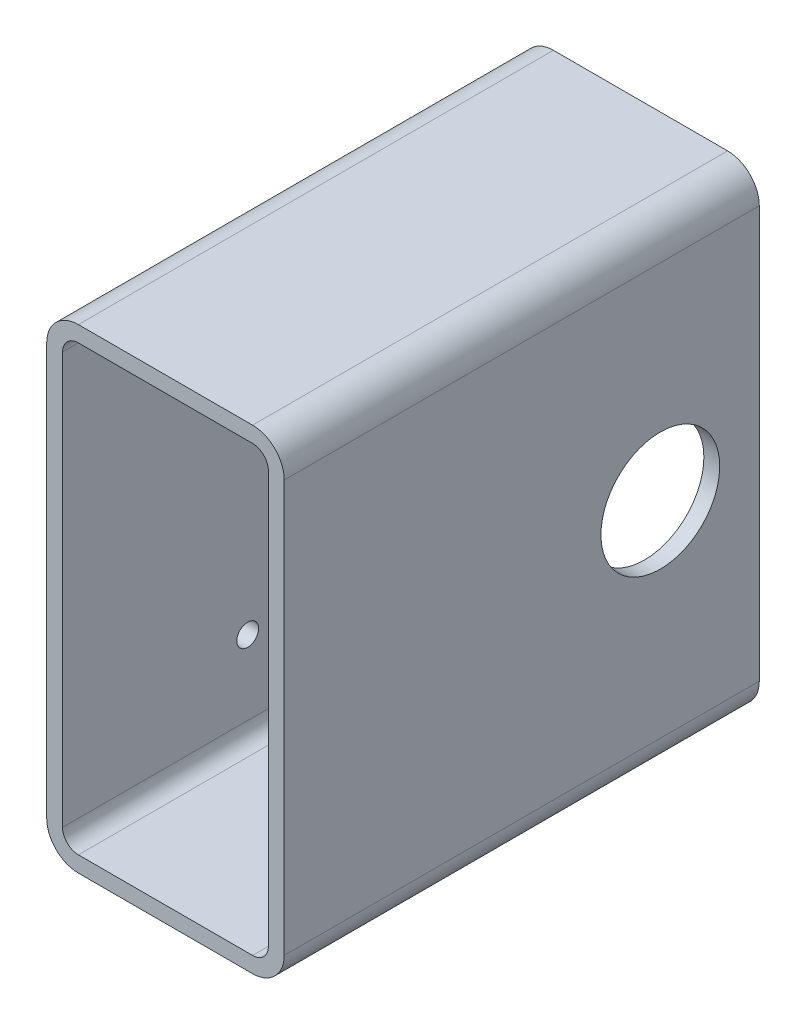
ISO-10303-21;
HEADER;
FILE_DESCRIPTION(('STEP AP214'),'2;1');
FILE_NAME('part.step','',(''),(''),'','','');
FILE_SCHEMA(('AUTOMOTIVE_DESIGN { 1 0 10303 214 1 1 1 1 }'));
ENDSEC;
DATA;
#1=APPLICATION_CONTEXT('core data for automotive mechanical design processes');
#2=APPLICATION_PROTOCOL_DEFINITION('international standard','automotive_design',2000,#1);
#3=PRODUCT_CONTEXT('',#1,'mechanical');
#4=PRODUCT('Part','Part','',(#3));
#5=PRODUCT_RELATED_PRODUCT_CATEGORY('part','',(#4));
#6=PRODUCT_DEFINITION_FORMATION('','',#4);
#7=PRODUCT_DEFINITION_CONTEXT('part definition',#1,'design');
#8=PRODUCT_DEFINITION('design','',#6,#7);
#9=PRODUCT_DEFINITION_SHAPE('','',#8);
#10=(LENGTH_UNIT() NAMED_UNIT(*) SI_UNIT(.MILLI.,.METRE.));
#11=(NAMED_UNIT(*) PLANE_ANGLE_UNIT() SI_UNIT($,.RADIAN.));
#12=(NAMED_UNIT(*) SI_UNIT($,.STERADIAN.) SOLID_ANGLE_UNIT());
#13=UNCERTAINTY_MEASURE_WITH_UNIT(LENGTH_MEASURE(1.E-05),#10,'distance_accuracy_value','');
#14=(GEOMETRIC_REPRESENTATION_CONTEXT(3) GLOBAL_UNCERTAINTY_ASSIGNED_CONTEXT((#13)) GLOBAL_UNIT_ASSIGNED_CONTEXT((#10,
#11,#12)) REPRESENTATION_CONTEXT('',''));
#15=CARTESIAN_POINT('',(0.,0.,0.));
#16=DIRECTION('',(0.,0.,1.));
#17=DIRECTION('',(1.,0.,0.));
#18=AXIS2_PLACEMENT_3D('',#15,#16,#17);
#19=CARTESIAN_POINT('',(52.,112.,60.));
#20=DIRECTION('',(0.,0.,1.));
#21=DIRECTION('',(1.,0.,0.));
#22=AXIS2_PLACEMENT_3D('',#19,#20,#21);
#23=PLANE('',#22);
#24=CARTESIAN_POINT('',(52.,112.,60.));
#25=DIRECTION('',(0.,0.,1.));
#26=DIRECTION('',(1.,0.,0.));
#27=AXIS2_PLACEMENT_3D('',#24,#25,#26);
#28=CIRCLE('',#27,8.);
#29=CARTESIAN_POINT('',(60.,112.,60.));
#30=VERTEX_POINT('',#29);
#31=CARTESIAN_POINT('',(52.,120.,60.));
#32=VERTEX_POINT('',#31);
#33=EDGE_CURVE('E223',#30,#32,#28,.T.);
#34=ORIENTED_EDGE('',*,*,#33,.T.);
#35=DIRECTION('',(-1.,0.,0.));
#36=VECTOR('',#35,1.);
#37=CARTESIAN_POINT('',(52.,120.,60.));
#38=LINE('',#37,#36);
#39=CARTESIAN_POINT('',(7.99999999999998,120.,60.));
#40=VERTEX_POINT('',#39);
#41=EDGE_CURVE('E226',#32,#40,#38,.T.);
#42=ORIENTED_EDGE('',*,*,#41,.T.);
#43=CARTESIAN_POINT('',(7.99999999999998,112.,60.));
#44=DIRECTION('',(0.,0.,1.));
#45=DIRECTION('',(1.,0.,0.));
#46=AXIS2_PLACEMENT_3D('',#43,#44,#45);
#47=CIRCLE('',#46,8.);
#48=CARTESIAN_POINT('',(0.,112.,60.));
#49=VERTEX_POINT('',#48);
#50=EDGE_CURVE('E228',#40,#49,#47,.T.);
#51=ORIENTED_EDGE('',*,*,#50,.T.);
#52=DIRECTION('',(0.,-1.,0.));
#53=VECTOR('',#52,1.);
#54=CARTESIAN_POINT('',(0.,8.,60.));
#55=LINE('',#54,#53);
#56=CARTESIAN_POINT('',(0.,8.,60.));
#57=VERTEX_POINT('',#56);
#58=EDGE_CURVE('E230',#49,#57,#55,.T.);
#59=ORIENTED_EDGE('',*,*,#58,.T.);
#60=CARTESIAN_POINT('',(8.,8.,60.));
#61=DIRECTION('',(0.,0.,1.));
#62=DIRECTION('',(1.,0.,0.));
#63=AXIS2_PLACEMENT_3D('',#60,#61,#62);
#64=CIRCLE('',#63,8.);
#65=CARTESIAN_POINT('',(8.,0.,60.));
#66=VERTEX_POINT('',#65);
#67=EDGE_CURVE('E232',#57,#66,#64,.T.);
#68=ORIENTED_EDGE('',*,*,#67,.T.);
#69=DIRECTION('',(1.,0.,0.));
#70=VECTOR('',#69,1.);
#71=CARTESIAN_POINT('',(8.,0.,60.));
#72=LINE('',#71,#70);
#73=CARTESIAN_POINT('',(52.,0.,60.));
#74=VERTEX_POINT('',#73);
#75=EDGE_CURVE('E234',#66,#74,#72,.T.);
#76=ORIENTED_EDGE('',*,*,#75,.T.);
#77=CARTESIAN_POINT('',(52.,8.00000000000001,60.));
#78=DIRECTION('',(0.,0.,1.));
#79=DIRECTION('',(1.,0.,0.));
#80=AXIS2_PLACEMENT_3D('',#77,#78,#79);
#81=CIRCLE('',#80,8.);
#82=CARTESIAN_POINT('',(60.,8.00000000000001,60.));
#83=VERTEX_POINT('',#82);
#84=EDGE_CURVE('E236',#74,#83,#81,.T.);
#85=ORIENTED_EDGE('',*,*,#84,.T.);
#86=DIRECTION('',(0.,1.,0.));
#87=VECTOR('',#86,1.);
#88=CARTESIAN_POINT('',(60.,112.,60.));
#89=LINE('',#88,#87);
#90=EDGE_CURVE('E238',#83,#30,#89,.T.);
#91=ORIENTED_EDGE('',*,*,#90,.T.);
#92=EDGE_LOOP('',(#34,#42,#51,#59,#68,#76,#85,#91));
#93=FACE_BOUND('',#92,.T.);
#94=DIRECTION('',(0.,-1.,0.));
#95=VECTOR('',#94,1.);
#96=CARTESIAN_POINT('',(4.,7.99999999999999,60.));
#97=LINE('',#96,#95);
#98=CARTESIAN_POINT('',(3.99999999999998,112.,60.));
#99=VERTEX_POINT('',#98);
#100=CARTESIAN_POINT('',(4.,7.99999999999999,60.));
#101=VERTEX_POINT('',#100);
#102=EDGE_CURVE('E181',#99,#101,#97,.T.);
#103=ORIENTED_EDGE('',*,*,#102,.F.);
#104=CARTESIAN_POINT('',(7.99999999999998,112.,60.));
#105=DIRECTION('',(0.,0.,1.));
#106=DIRECTION('',(1.,0.,0.));
#107=AXIS2_PLACEMENT_3D('',#104,#105,#106);
#108=CIRCLE('',#107,4.);
#109=CARTESIAN_POINT('',(7.99999999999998,116.,60.));
#110=VERTEX_POINT('',#109);
#111=EDGE_CURVE('E153',#110,#99,#108,.T.);
#112=ORIENTED_EDGE('',*,*,#111,.F.);
#113=DIRECTION('',(-1.,0.,0.));
#114=VECTOR('',#113,1.);
#115=CARTESIAN_POINT('',(52.,116.,60.));
#116=LINE('',#115,#114);
#117=CARTESIAN_POINT('',(52.,116.,60.));
#118=VERTEX_POINT('',#117);
#119=EDGE_CURVE('E193',#118,#110,#116,.T.);
#120=ORIENTED_EDGE('',*,*,#119,.F.);
#121=CARTESIAN_POINT('',(52.,112.,60.));
#122=DIRECTION('',(0.,0.,1.));
#123=DIRECTION('',(1.,0.,0.));
#124=AXIS2_PLACEMENT_3D('',#121,#122,#123);
#125=CIRCLE('',#124,4.);
#126=CARTESIAN_POINT('',(56.,112.,60.));
#127=VERTEX_POINT('',#126);
#128=EDGE_CURVE('E191',#127,#118,#125,.T.);
#129=ORIENTED_EDGE('',*,*,#128,.F.);
#130=DIRECTION('',(0.,1.,0.));
#131=VECTOR('',#130,1.);
#132=CARTESIAN_POINT('',(56.,112.,60.));
#133=LINE('',#132,#131);
#134=CARTESIAN_POINT('',(56.,8.00000000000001,60.));
#135=VERTEX_POINT('',#134);
#136=EDGE_CURVE('E189',#135,#127,#133,.T.);
#137=ORIENTED_EDGE('',*,*,#136,.F.);
#138=CARTESIAN_POINT('',(52.,8.00000000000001,60.));
#139=DIRECTION('',(0.,0.,1.));
#140=DIRECTION('',(1.,0.,0.));
#141=AXIS2_PLACEMENT_3D('',#138,#139,#140);
#142=CIRCLE('',#141,4.00000000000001);
#143=CARTESIAN_POINT('',(52.,4.,60.));
#144=VERTEX_POINT('',#143);
#145=EDGE_CURVE('E187',#144,#135,#142,.T.);
#146=ORIENTED_EDGE('',*,*,#145,.F.);
#147=DIRECTION('',(1.,0.,0.));
#148=VECTOR('',#147,1.);
#149=CARTESIAN_POINT('',(8.,3.99999999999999,60.));
#150=LINE('',#149,#148);
#151=CARTESIAN_POINT('',(8.,3.99999999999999,60.));
#152=VERTEX_POINT('',#151);
#153=EDGE_CURVE('E185',#152,#144,#150,.T.);
#154=ORIENTED_EDGE('',*,*,#153,.F.);
#155=CARTESIAN_POINT('',(8.,7.99999999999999,60.));
#156=DIRECTION('',(0.,0.,1.));
#157=DIRECTION('',(1.,0.,0.));
#158=AXIS2_PLACEMENT_3D('',#155,#156,#157);
#159=CIRCLE('',#158,4.);
#160=EDGE_CURVE('E183',#101,#152,#159,.T.);
#161=ORIENTED_EDGE('',*,*,#160,.F.);
#162=EDGE_LOOP('',(#103,#112,#120,#129,#137,#146,#154,#161));
#163=FACE_BOUND('',#162,.T.);
#164=ADVANCED_FACE('F24',(#93,#163),#23,.T.);
#165=CARTESIAN_POINT('',(52.,112.,-60.));
#166=DIRECTION('',(0.,0.,1.));
#167=DIRECTION('',(1.,0.,0.));
#168=AXIS2_PLACEMENT_3D('',#165,#166,#167);
#169=PLANE('',#168);
#170=CARTESIAN_POINT('',(52.,112.,-60.));
#171=DIRECTION('',(0.,0.,1.));
#172=DIRECTION('',(1.,0.,0.));
#173=AXIS2_PLACEMENT_3D('',#170,#171,#172);
#174=CIRCLE('',#173,8.);
#175=CARTESIAN_POINT('',(60.,112.,-60.));
#176=VERTEX_POINT('',#175);
#177=CARTESIAN_POINT('',(52.,120.,-60.));
#178=VERTEX_POINT('',#177);
#179=EDGE_CURVE('E154',#176,#178,#174,.T.);
#180=ORIENTED_EDGE('',*,*,#179,.F.);
#181=DIRECTION('',(0.,1.,0.));
#182=VECTOR('',#181,1.);
#183=CARTESIAN_POINT('',(60.,112.,-60.));
#184=LINE('',#183,#182);
#185=CARTESIAN_POINT('',(60.,8.00000000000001,-60.));
#186=VERTEX_POINT('',#185);
#187=EDGE_CURVE('E221',#186,#176,#184,.T.);
#188=ORIENTED_EDGE('',*,*,#187,.F.);
#189=CARTESIAN_POINT('',(52.,8.00000000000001,-60.));
#190=DIRECTION('',(0.,0.,1.));
#191=DIRECTION('',(1.,0.,0.));
#192=AXIS2_PLACEMENT_3D('',#189,#190,#191);
#193=CIRCLE('',#192,8.);
#194=CARTESIAN_POINT('',(52.,0.,-60.));
#195=VERTEX_POINT('',#194);
#196=EDGE_CURVE('E219',#195,#186,#193,.T.);
#197=ORIENTED_EDGE('',*,*,#196,.F.);
#198=DIRECTION('',(1.,0.,0.));
#199=VECTOR('',#198,1.);
#200=CARTESIAN_POINT('',(8.,0.,-60.));
#201=LINE('',#200,#199);
#202=CARTESIAN_POINT('',(8.,0.,-60.));
#203=VERTEX_POINT('',#202);
#204=EDGE_CURVE('E217',#203,#195,#201,.T.);
#205=ORIENTED_EDGE('',*,*,#204,.F.);
#206=CARTESIAN_POINT('',(8.,8.,-60.));
#207=DIRECTION('',(0.,0.,1.));
#208=DIRECTION('',(1.,0.,0.));
#209=AXIS2_PLACEMENT_3D('',#206,#207,#208);
#210=CIRCLE('',#209,8.);
#211=CARTESIAN_POINT('',(0.,8.,-60.));
#212=VERTEX_POINT('',#211);
#213=EDGE_CURVE('E215',#212,#203,#210,.T.);
#214=ORIENTED_EDGE('',*,*,#213,.F.);
#215=DIRECTION('',(0.,-1.,0.));
#216=VECTOR('',#215,1.);
#217=CARTESIAN_POINT('',(0.,8.,-60.));
#218=LINE('',#217,#216);
#219=CARTESIAN_POINT('',(0.,112.,-60.));
#220=VERTEX_POINT('',#219);
#221=EDGE_CURVE('E213',#220,#212,#218,.T.);
#222=ORIENTED_EDGE('',*,*,#221,.F.);
#223=CARTESIAN_POINT('',(7.99999999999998,112.,-60.));
#224=DIRECTION('',(0.,0.,1.));
#225=DIRECTION('',(1.,0.,0.));
#226=AXIS2_PLACEMENT_3D('',#223,#224,#225);
#227=CIRCLE('',#226,8.);
#228=CARTESIAN_POINT('',(7.99999999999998,120.,-60.));
#229=VERTEX_POINT('',#228);
#230=EDGE_CURVE('E211',#229,#220,#227,.T.);
#231=ORIENTED_EDGE('',*,*,#230,.F.);
#232=DIRECTION('',(-1.,0.,0.));
#233=VECTOR('',#232,1.);
#234=CARTESIAN_POINT('',(52.,120.,-60.));
#235=LINE('',#234,#233);
#236=EDGE_CURVE('E209',#178,#229,#235,.T.);
#237=ORIENTED_EDGE('',*,*,#236,.F.);
#238=EDGE_LOOP('',(#180,#188,#197,#205,#214,#222,#231,#237));
#239=FACE_BOUND('',#238,.T.);
#240=CARTESIAN_POINT('',(7.99999999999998,112.,-60.));
#241=DIRECTION('',(0.,0.,1.));
#242=DIRECTION('',(1.,0.,0.));
#243=AXIS2_PLACEMENT_3D('',#240,#241,#242);
#244=CIRCLE('',#243,4.);
#245=CARTESIAN_POINT('',(7.99999999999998,116.,-60.));
#246=VERTEX_POINT('',#245);
#247=CARTESIAN_POINT('',(3.99999999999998,112.,-60.));
#248=VERTEX_POINT('',#247);
#249=EDGE_CURVE('E48',#246,#248,#244,.T.);
#250=ORIENTED_EDGE('',*,*,#249,.T.);
#251=DIRECTION('',(0.,-1.,0.));
#252=VECTOR('',#251,1.);
#253=CARTESIAN_POINT('',(4.,7.99999999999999,-60.));
#254=LINE('',#253,#252);
#255=CARTESIAN_POINT('',(4.,7.99999999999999,-60.));
#256=VERTEX_POINT('',#255);
#257=EDGE_CURVE('E140',#248,#256,#254,.T.);
#258=ORIENTED_EDGE('',*,*,#257,.T.);
#259=CARTESIAN_POINT('',(8.,7.99999999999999,-60.));
#260=DIRECTION('',(0.,0.,1.));
#261=DIRECTION('',(1.,0.,0.));
#262=AXIS2_PLACEMENT_3D('',#259,#260,#261);
#263=CIRCLE('',#262,4.);
#264=CARTESIAN_POINT('',(8.,3.99999999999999,-60.));
#265=VERTEX_POINT('',#264);
#266=EDGE_CURVE('E149',#256,#265,#263,.T.);
#267=ORIENTED_EDGE('',*,*,#266,.T.);
#268=DIRECTION('',(1.,0.,0.));
#269=VECTOR('',#268,1.);
#270=CARTESIAN_POINT('',(8.,3.99999999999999,-60.));
#271=LINE('',#270,#269);
#272=CARTESIAN_POINT('',(52.,4.,-60.));
#273=VERTEX_POINT('',#272);
#274=EDGE_CURVE('E168',#265,#273,#271,.T.);
#275=ORIENTED_EDGE('',*,*,#274,.T.);
#276=CARTESIAN_POINT('',(52.,8.00000000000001,-60.));
#277=DIRECTION('',(0.,0.,1.));
#278=DIRECTION('',(1.,0.,0.));
#279=AXIS2_PLACEMENT_3D('',#276,#277,#278);
#280=CIRCLE('',#279,4.00000000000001);
#281=CARTESIAN_POINT('',(56.,8.00000000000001,-60.));
#282=VERTEX_POINT('',#281);
#283=EDGE_CURVE('E171',#273,#282,#280,.T.);
#284=ORIENTED_EDGE('',*,*,#283,.T.);
#285=DIRECTION('',(0.,1.,0.));
#286=VECTOR('',#285,1.);
#287=CARTESIAN_POINT('',(56.,112.,-60.));
#288=LINE('',#287,#286);
#289=CARTESIAN_POINT('',(56.,112.,-60.));
#290=VERTEX_POINT('',#289);
#291=EDGE_CURVE('E174',#282,#290,#288,.T.);
#292=ORIENTED_EDGE('',*,*,#291,.T.);
#293=CARTESIAN_POINT('',(52.,112.,-60.));
#294=DIRECTION('',(0.,0.,1.));
#295=DIRECTION('',(1.,0.,0.));
#296=AXIS2_PLACEMENT_3D('',#293,#294,#295);
#297=CIRCLE('',#296,4.);
#298=CARTESIAN_POINT('',(52.,116.,-60.));
#299=VERTEX_POINT('',#298);
#300=EDGE_CURVE('E177',#290,#299,#297,.T.);
#301=ORIENTED_EDGE('',*,*,#300,.T.);
#302=DIRECTION('',(-1.,0.,0.));
#303=VECTOR('',#302,1.);
#304=CARTESIAN_POINT('',(52.,116.,-60.));
#305=LINE('',#304,#303);
#306=EDGE_CURVE('E159',#299,#246,#305,.T.);
#307=ORIENTED_EDGE('',*,*,#306,.T.);
#308=EDGE_LOOP('',(#250,#258,#267,#275,#284,#292,#301,#307));
#309=FACE_BOUND('',#308,.T.);
#310=ADVANCED_FACE('F157',(#239,#309),#169,.F.);
#311=CARTESIAN_POINT('',(52.,112.,60.));
#312=DIRECTION('',(0.,0.,-1.));
#313=DIRECTION('',(-1.,0.,0.));
#314=AXIS2_PLACEMENT_3D('',#311,#312,#313);
#315=CYLINDRICAL_SURFACE('',#314,8.);
#316=ORIENTED_EDGE('',*,*,#179,.T.);
#317=DIRECTION('',(0.,0.,-1.));
#318=VECTOR('',#317,1.);
#319=CARTESIAN_POINT('',(52.,120.,60.));
#320=LINE('',#319,#318);
#321=EDGE_CURVE('E11',#32,#178,#320,.T.);
#322=ORIENTED_EDGE('',*,*,#321,.F.);
#323=ORIENTED_EDGE('',*,*,#33,.F.);
#324=DIRECTION('',(0.,0.,-1.));
#325=VECTOR('',#324,1.);
#326=CARTESIAN_POINT('',(60.,112.,60.));
#327=LINE('',#326,#325);
#328=EDGE_CURVE('E240',#30,#176,#327,.T.);
#329=ORIENTED_EDGE('',*,*,#328,.T.);
#330=EDGE_LOOP('',(#316,#322,#323,#329));
#331=FACE_BOUND('',#330,.T.);
#332=ADVANCED_FACE('F26',(#331),#315,.T.);
#333=CARTESIAN_POINT('',(52.,120.,60.));
#334=DIRECTION('',(0.,-1.,0.));
#335=DIRECTION('',(0.,0.,-1.));
#336=AXIS2_PLACEMENT_3D('',#333,#334,#335);
#337=PLANE('',#336);
#338=ORIENTED_EDGE('',*,*,#236,.T.);
#339=DIRECTION('',(0.,0.,-1.));
#340=VECTOR('',#339,1.);
#341=CARTESIAN_POINT('',(7.99999999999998,120.,60.));
#342=LINE('',#341,#340);
#343=EDGE_CURVE('E33',#40,#229,#342,.T.);
#344=ORIENTED_EDGE('',*,*,#343,.F.);
#345=ORIENTED_EDGE('',*,*,#41,.F.);
#346=ORIENTED_EDGE('',*,*,#321,.T.);
#347=EDGE_LOOP('',(#338,#344,#345,#346));
#348=FACE_BOUND('',#347,.T.);
#349=ADVANCED_FACE('F285',(#348),#337,.F.);
#350=CARTESIAN_POINT('',(7.99999999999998,112.,60.));
#351=DIRECTION('',(0.,0.,-1.));
#352=DIRECTION('',(-1.,0.,0.));
#353=AXIS2_PLACEMENT_3D('',#350,#351,#352);
#354=CYLINDRICAL_SURFACE('',#353,8.);
#355=ORIENTED_EDGE('',*,*,#230,.T.);
#356=DIRECTION('',(0.,0.,-1.));
#357=VECTOR('',#356,1.);
#358=CARTESIAN_POINT('',(0.,112.,60.));
#359=LINE('',#358,#357);
#360=EDGE_CURVE('E255',#49,#220,#359,.T.);
#361=ORIENTED_EDGE('',*,*,#360,.F.);
#362=ORIENTED_EDGE('',*,*,#50,.F.);
#363=ORIENTED_EDGE('',*,*,#343,.T.);
#364=EDGE_LOOP('',(#355,#361,#362,#363));
#365=FACE_BOUND('',#364,.T.);
#366=ADVANCED_FACE('F263',(#365),#354,.T.);
#367=CARTESIAN_POINT('',(0.,8.,60.));
#368=DIRECTION('',(1.,0.,0.));
#369=DIRECTION('',(0.,1.,0.));
#370=AXIS2_PLACEMENT_3D('',#367,#368,#369);
#371=PLANE('',#370);
#372=CARTESIAN_POINT('',(0.,93.2340187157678,-53.2340187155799));
#373=DIRECTION('',(-1.,0.,0.));
#374=DIRECTION('',(0.,-1.,0.));
#375=AXIS2_PLACEMENT_3D('',#372,#373,#374);
#376=CIRCLE('',#375,2.75);
#377=CARTESIAN_POINT('',(0.,90.4840187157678,-53.2340187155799));
#378=VERTEX_POINT('',#377);
#379=EDGE_CURVE('E330',#378,#378,#376,.T.);
#380=ORIENTED_EDGE('',*,*,#379,.F.);
#381=EDGE_LOOP('',(#380));
#382=FACE_BOUND('',#381,.T.);
#383=CARTESIAN_POINT('',(0.,93.2340187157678,13.2340187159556));
#384=DIRECTION('',(-1.,0.,0.));
#385=DIRECTION('',(0.,-1.,0.));
#386=AXIS2_PLACEMENT_3D('',#383,#384,#385);
#387=CIRCLE('',#386,2.74999999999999);
#388=CARTESIAN_POINT('',(0.,90.4840187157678,13.2340187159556));
#389=VERTEX_POINT('',#388);
#390=EDGE_CURVE('E336',#389,#389,#387,.T.);
#391=ORIENTED_EDGE('',*,*,#390,.F.);
#392=EDGE_LOOP('',(#391));
#393=FACE_BOUND('',#392,.T.);
#394=CARTESIAN_POINT('',(0.,26.7659812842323,13.2340187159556));
#395=DIRECTION('',(-1.,0.,0.));
#396=DIRECTION('',(0.,-1.,0.));
#397=AXIS2_PLACEMENT_3D('',#394,#395,#396);
#398=CIRCLE('',#397,2.75);
#399=CARTESIAN_POINT('',(0.,24.0159812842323,13.2340187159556));
#400=VERTEX_POINT('',#399);
#401=EDGE_CURVE('E342',#400,#400,#398,.T.);
#402=ORIENTED_EDGE('',*,*,#401,.F.);
#403=EDGE_LOOP('',(#402));
#404=FACE_BOUND('',#403,.T.);
#405=CARTESIAN_POINT('',(0.,26.7659812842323,-53.2340187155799));
#406=DIRECTION('',(-1.,0.,0.));
#407=DIRECTION('',(0.,-1.,0.));
#408=AXIS2_PLACEMENT_3D('',#405,#406,#407);
#409=CIRCLE('',#408,2.74999999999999);
#410=CARTESIAN_POINT('',(0.,24.0159812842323,-53.2340187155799));
#411=VERTEX_POINT('',#410);
#412=EDGE_CURVE('E348',#411,#411,#409,.T.);
#413=ORIENTED_EDGE('',*,*,#412,.F.);
#414=EDGE_LOOP('',(#413));
#415=FACE_BOUND('',#414,.T.);
#416=CARTESIAN_POINT('',(0.,60.0000000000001,-34.9999999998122));
#417=DIRECTION('',(-1.,0.,0.));
#418=DIRECTION('',(0.,-1.,0.));
#419=AXIS2_PLACEMENT_3D('',#416,#417,#418);
#420=CIRCLE('',#419,15.);
#421=CARTESIAN_POINT('',(0.,45.0000000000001,-34.9999999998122));
#422=VERTEX_POINT('',#421);
#423=EDGE_CURVE('E160',#422,#422,#420,.T.);
#424=ORIENTED_EDGE('',*,*,#423,.F.);
#425=EDGE_LOOP('',(#424));
#426=FACE_BOUND('',#425,.T.);
#427=ORIENTED_EDGE('',*,*,#221,.T.);
#428=DIRECTION('',(0.,0.,-1.));
#429=VECTOR('',#428,1.);
#430=CARTESIAN_POINT('',(0.,8.,60.));
#431=LINE('',#430,#429);
#432=EDGE_CURVE('E252',#57,#212,#431,.T.);
#433=ORIENTED_EDGE('',*,*,#432,.F.);
#434=ORIENTED_EDGE('',*,*,#58,.F.);
#435=ORIENTED_EDGE('',*,*,#360,.T.);
#436=EDGE_LOOP('',(#427,#433,#434,#435));
#437=FACE_BOUND('',#436,.T.);
#438=ADVANCED_FACE('F273',(#382,#393,#404,#415,#426,#437),#371,.F.);
#439=CARTESIAN_POINT('',(8.,8.,60.));
#440=DIRECTION('',(0.,0.,-1.));
#441=DIRECTION('',(-1.,0.,0.));
#442=AXIS2_PLACEMENT_3D('',#439,#440,#441);
#443=CYLINDRICAL_SURFACE('',#442,8.);
#444=ORIENTED_EDGE('',*,*,#213,.T.);
#445=DIRECTION('',(0.,0.,-1.));
#446=VECTOR('',#445,1.);
#447=CARTESIAN_POINT('',(8.,0.,60.));
#448=LINE('',#447,#446);
#449=EDGE_CURVE('E249',#66,#203,#448,.T.);
#450=ORIENTED_EDGE('',*,*,#449,.F.);
#451=ORIENTED_EDGE('',*,*,#67,.F.);
#452=ORIENTED_EDGE('',*,*,#432,.T.);
#453=EDGE_LOOP('',(#444,#450,#451,#452));
#454=FACE_BOUND('',#453,.T.);
#455=ADVANCED_FACE('F277',(#454),#443,.T.);
#456=CARTESIAN_POINT('',(8.,0.,60.));
#457=DIRECTION('',(0.,1.,0.));
#458=DIRECTION('',(0.,0.,1.));
#459=AXIS2_PLACEMENT_3D('',#456,#457,#458);
#460=PLANE('',#459);
#461=ORIENTED_EDGE('',*,*,#204,.T.);
#462=DIRECTION('',(0.,0.,-1.));
#463=VECTOR('',#462,1.);
#464=CARTESIAN_POINT('',(52.,0.,60.));
#465=LINE('',#464,#463);
#466=EDGE_CURVE('E246',#74,#195,#465,.T.);
#467=ORIENTED_EDGE('',*,*,#466,.F.);
#468=ORIENTED_EDGE('',*,*,#75,.F.);
#469=ORIENTED_EDGE('',*,*,#449,.T.);
#470=EDGE_LOOP('',(#461,#467,#468,#469));
#471=FACE_BOUND('',#470,.T.);
#472=ADVANCED_FACE('F298',(#471),#460,.F.);
#473=CARTESIAN_POINT('',(52.,8.00000000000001,60.));
#474=DIRECTION('',(0.,0.,-1.));
#475=DIRECTION('',(-1.,0.,0.));
#476=AXIS2_PLACEMENT_3D('',#473,#474,#475);
#477=CYLINDRICAL_SURFACE('',#476,8.);
#478=ORIENTED_EDGE('',*,*,#196,.T.);
#479=DIRECTION('',(0.,0.,-1.));
#480=VECTOR('',#479,1.);
#481=CARTESIAN_POINT('',(60.,8.00000000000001,60.));
#482=LINE('',#481,#480);
#483=EDGE_CURVE('E243',#83,#186,#482,.T.);
#484=ORIENTED_EDGE('',*,*,#483,.F.);
#485=ORIENTED_EDGE('',*,*,#84,.F.);
#486=ORIENTED_EDGE('',*,*,#466,.T.);
#487=EDGE_LOOP('',(#478,#484,#485,#486));
#488=FACE_BOUND('',#487,.T.);
#489=ADVANCED_FACE('F296',(#488),#477,.T.);
#490=CARTESIAN_POINT('',(60.,112.,60.));
#491=DIRECTION('',(-1.,0.,0.));
#492=DIRECTION('',(0.,-1.,0.));
#493=AXIS2_PLACEMENT_3D('',#490,#491,#492);
#494=PLANE('',#493);
#495=CARTESIAN_POINT('',(60.,60.0000000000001,-34.9999999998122));
#496=DIRECTION('',(1.,0.,0.));
#497=DIRECTION('',(0.,1.,0.));
#498=AXIS2_PLACEMENT_3D('',#495,#496,#497);
#499=CIRCLE('',#498,15.);
#500=CARTESIAN_POINT('',(60.,75.0000000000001,-34.9999999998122));
#501=VERTEX_POINT('',#500);
#502=EDGE_CURVE('E322',#501,#501,#499,.T.);
#503=ORIENTED_EDGE('',*,*,#502,.F.);
#504=EDGE_LOOP('',(#503));
#505=FACE_BOUND('',#504,.T.);
#506=ORIENTED_EDGE('',*,*,#187,.T.);
#507=ORIENTED_EDGE('',*,*,#328,.F.);
#508=ORIENTED_EDGE('',*,*,#90,.F.);
#509=ORIENTED_EDGE('',*,*,#483,.T.);
#510=EDGE_LOOP('',(#506,#507,#508,#509));
#511=FACE_BOUND('',#510,.T.);
#512=ADVANCED_FACE('F291',(#505,#511),#494,.F.);
#513=CARTESIAN_POINT('',(7.99999999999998,112.,60.));
#514=DIRECTION('',(0.,0.,-1.));
#515=DIRECTION('',(-1.,0.,0.));
#516=AXIS2_PLACEMENT_3D('',#513,#514,#515);
#517=CYLINDRICAL_SURFACE('',#516,4.);
#518=ORIENTED_EDGE('',*,*,#249,.F.);
#519=DIRECTION('',(0.,0.,-1.));
#520=VECTOR('',#519,1.);
#521=CARTESIAN_POINT('',(7.99999999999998,116.,60.));
#522=LINE('',#521,#520);
#523=EDGE_CURVE('E195',#110,#246,#522,.T.);
#524=ORIENTED_EDGE('',*,*,#523,.F.);
#525=ORIENTED_EDGE('',*,*,#111,.T.);
#526=DIRECTION('',(0.,0.,-1.));
#527=VECTOR('',#526,1.);
#528=CARTESIAN_POINT('',(3.99999999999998,112.,60.));
#529=LINE('',#528,#527);
#530=EDGE_CURVE('E142',#99,#248,#529,.T.);
#531=ORIENTED_EDGE('',*,*,#530,.T.);
#532=EDGE_LOOP('',(#518,#524,#525,#531));
#533=FACE_BOUND('',#532,.T.);
#534=ADVANCED_FACE('F151',(#533),#517,.F.);
#535=CARTESIAN_POINT('',(4.,7.99999999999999,60.));
#536=DIRECTION('',(1.,0.,0.));
#537=DIRECTION('',(0.,1.,0.));
#538=AXIS2_PLACEMENT_3D('',#535,#536,#537);
#539=PLANE('',#538);
#540=CARTESIAN_POINT('',(3.99999999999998,93.2340187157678,-53.2340187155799));
#541=DIRECTION('',(1.,0.,0.));
#542=DIRECTION('',(0.,1.,0.));
#543=AXIS2_PLACEMENT_3D('',#540,#541,#542);
#544=CIRCLE('',#543,2.75);
#545=CARTESIAN_POINT('',(3.99999999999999,90.4840187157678,-53.2340187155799));
#546=VERTEX_POINT('',#545);
#547=EDGE_CURVE('E326',#546,#546,#544,.F.);
#548=ORIENTED_EDGE('',*,*,#547,.T.);
#549=EDGE_LOOP('',(#548));
#550=FACE_BOUND('',#549,.T.);
#551=CARTESIAN_POINT('',(3.99999999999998,93.2340187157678,13.2340187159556));
#552=DIRECTION('',(1.,0.,0.));
#553=DIRECTION('',(0.,1.,0.));
#554=AXIS2_PLACEMENT_3D('',#551,#552,#553);
#555=CIRCLE('',#554,2.74999999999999);
#556=CARTESIAN_POINT('',(3.99999999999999,90.4840187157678,13.2340187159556));
#557=VERTEX_POINT('',#556);
#558=EDGE_CURVE('E333',#557,#557,#555,.F.);
#559=ORIENTED_EDGE('',*,*,#558,.T.);
#560=EDGE_LOOP('',(#559));
#561=FACE_BOUND('',#560,.T.);
#562=CARTESIAN_POINT('',(4.,26.7659812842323,13.2340187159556));
#563=DIRECTION('',(1.,0.,0.));
#564=DIRECTION('',(0.,1.,0.));
#565=AXIS2_PLACEMENT_3D('',#562,#563,#564);
#566=CIRCLE('',#565,2.75);
#567=CARTESIAN_POINT('',(4.,24.0159812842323,13.2340187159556));
#568=VERTEX_POINT('',#567);
#569=EDGE_CURVE('E339',#568,#568,#566,.F.);
#570=ORIENTED_EDGE('',*,*,#569,.T.);
#571=EDGE_LOOP('',(#570));
#572=FACE_BOUND('',#571,.T.);
#573=CARTESIAN_POINT('',(4.,26.7659812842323,-53.2340187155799));
#574=DIRECTION('',(1.,0.,0.));
#575=DIRECTION('',(0.,1.,0.));
#576=AXIS2_PLACEMENT_3D('',#573,#574,#575);
#577=CIRCLE('',#576,2.74999999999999);
#578=CARTESIAN_POINT('',(4.,24.0159812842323,-53.2340187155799));
#579=VERTEX_POINT('',#578);
#580=EDGE_CURVE('E345',#579,#579,#577,.F.);
#581=ORIENTED_EDGE('',*,*,#580,.T.);
#582=EDGE_LOOP('',(#581));
#583=FACE_BOUND('',#582,.T.);
#584=CARTESIAN_POINT('',(3.99999999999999,60.0000000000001,-34.9999999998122));
#585=DIRECTION('',(1.,0.,0.));
#586=DIRECTION('',(0.,1.,0.));
#587=AXIS2_PLACEMENT_3D('',#584,#585,#586);
#588=CIRCLE('',#587,15.);
#589=CARTESIAN_POINT('',(3.99999999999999,45.0000000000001,-34.9999999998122));
#590=VERTEX_POINT('',#589);
#591=EDGE_CURVE('E163',#590,#590,#588,.F.);
#592=ORIENTED_EDGE('',*,*,#591,.T.);
#593=EDGE_LOOP('',(#592));
#594=FACE_BOUND('',#593,.T.);
#595=ORIENTED_EDGE('',*,*,#257,.F.);
#596=ORIENTED_EDGE('',*,*,#530,.F.);
#597=ORIENTED_EDGE('',*,*,#102,.T.);
#598=DIRECTION('',(0.,0.,-1.));
#599=VECTOR('',#598,1.);
#600=CARTESIAN_POINT('',(4.,7.99999999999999,60.));
#601=LINE('',#600,#599);
#602=EDGE_CURVE('E145',#101,#256,#601,.T.);
#603=ORIENTED_EDGE('',*,*,#602,.T.);
#604=EDGE_LOOP('',(#595,#596,#597,#603));
#605=FACE_BOUND('',#604,.T.);
#606=ADVANCED_FACE('F141',(#550,#561,#572,#583,#594,#605),#539,.T.);
#607=CARTESIAN_POINT('',(8.,7.99999999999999,60.));
#608=DIRECTION('',(0.,0.,-1.));
#609=DIRECTION('',(-1.,0.,0.));
#610=AXIS2_PLACEMENT_3D('',#607,#608,#609);
#611=CYLINDRICAL_SURFACE('',#610,4.);
#612=ORIENTED_EDGE('',*,*,#266,.F.);
#613=ORIENTED_EDGE('',*,*,#602,.F.);
#614=ORIENTED_EDGE('',*,*,#160,.T.);
#615=DIRECTION('',(0.,0.,-1.));
#616=VECTOR('',#615,1.);
#617=CARTESIAN_POINT('',(8.,3.99999999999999,60.));
#618=LINE('',#617,#616);
#619=EDGE_CURVE('E204',#152,#265,#618,.T.);
#620=ORIENTED_EDGE('',*,*,#619,.T.);
#621=EDGE_LOOP('',(#612,#613,#614,#620));
#622=FACE_BOUND('',#621,.T.);
#623=ADVANCED_FACE('F414',(#622),#611,.F.);
#624=CARTESIAN_POINT('',(8.,3.99999999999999,60.));
#625=DIRECTION('',(0.,1.,0.));
#626=DIRECTION('',(-1.,0.,0.));
#627=AXIS2_PLACEMENT_3D('',#624,#625,#626);
#628=PLANE('',#627);
#629=ORIENTED_EDGE('',*,*,#274,.F.);
#630=ORIENTED_EDGE('',*,*,#619,.F.);
#631=ORIENTED_EDGE('',*,*,#153,.T.);
#632=DIRECTION('',(0.,0.,-1.));
#633=VECTOR('',#632,1.);
#634=CARTESIAN_POINT('',(52.,4.,60.));
#635=LINE('',#634,#633);
#636=EDGE_CURVE('E202',#144,#273,#635,.T.);
#637=ORIENTED_EDGE('',*,*,#636,.T.);
#638=EDGE_LOOP('',(#629,#630,#631,#637));
#639=FACE_BOUND('',#638,.T.);
#640=ADVANCED_FACE('F422',(#639),#628,.T.);
#641=CARTESIAN_POINT('',(52.,8.00000000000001,60.));
#642=DIRECTION('',(0.,0.,-1.));
#643=DIRECTION('',(-1.,0.,0.));
#644=AXIS2_PLACEMENT_3D('',#641,#642,#643);
#645=CYLINDRICAL_SURFACE('',#644,4.00000000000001);
#646=ORIENTED_EDGE('',*,*,#283,.F.);
#647=ORIENTED_EDGE('',*,*,#636,.F.);
#648=ORIENTED_EDGE('',*,*,#145,.T.);
#649=DIRECTION('',(0.,0.,-1.));
#650=VECTOR('',#649,1.);
#651=CARTESIAN_POINT('',(56.,8.00000000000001,60.));
#652=LINE('',#651,#650);
#653=EDGE_CURVE('E200',#135,#282,#652,.T.);
#654=ORIENTED_EDGE('',*,*,#653,.T.);
#655=EDGE_LOOP('',(#646,#647,#648,#654));
#656=FACE_BOUND('',#655,.T.);
#657=ADVANCED_FACE('F430',(#656),#645,.F.);
#658=CARTESIAN_POINT('',(56.,112.,60.));
#659=DIRECTION('',(-1.,0.,0.));
#660=DIRECTION('',(0.,-1.,0.));
#661=AXIS2_PLACEMENT_3D('',#658,#659,#660);
#662=PLANE('',#661);
#663=CARTESIAN_POINT('',(56.,60.0000000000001,-34.9999999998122));
#664=DIRECTION('',(-1.,0.,0.));
#665=DIRECTION('',(0.,-1.,0.));
#666=AXIS2_PLACEMENT_3D('',#663,#664,#665);
#667=CIRCLE('',#666,15.);
#668=CARTESIAN_POINT('',(56.,45.0000000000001,-34.9999999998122));
#669=VERTEX_POINT('',#668);
#670=EDGE_CURVE('E28',#669,#669,#667,.T.);
#671=ORIENTED_EDGE('',*,*,#670,.F.);
#672=EDGE_LOOP('',(#671));
#673=FACE_BOUND('',#672,.T.);
#674=ORIENTED_EDGE('',*,*,#291,.F.);
#675=ORIENTED_EDGE('',*,*,#653,.F.);
#676=ORIENTED_EDGE('',*,*,#136,.T.);
#677=DIRECTION('',(0.,0.,-1.));
#678=VECTOR('',#677,1.);
#679=CARTESIAN_POINT('',(56.,112.,60.));
#680=LINE('',#679,#678);
#681=EDGE_CURVE('E198',#127,#290,#680,.T.);
#682=ORIENTED_EDGE('',*,*,#681,.T.);
#683=EDGE_LOOP('',(#674,#675,#676,#682));
#684=FACE_BOUND('',#683,.T.);
#685=ADVANCED_FACE('F438',(#673,#684),#662,.T.);
#686=CARTESIAN_POINT('',(52.,112.,60.));
#687=DIRECTION('',(0.,0.,-1.));
#688=DIRECTION('',(-1.,0.,0.));
#689=AXIS2_PLACEMENT_3D('',#686,#687,#688);
#690=CYLINDRICAL_SURFACE('',#689,4.);
#691=ORIENTED_EDGE('',*,*,#300,.F.);
#692=ORIENTED_EDGE('',*,*,#681,.F.);
#693=ORIENTED_EDGE('',*,*,#128,.T.);
#694=DIRECTION('',(0.,0.,-1.));
#695=VECTOR('',#694,1.);
#696=CARTESIAN_POINT('',(52.,116.,60.));
#697=LINE('',#696,#695);
#698=EDGE_CURVE('E40',#118,#299,#697,.T.);
#699=ORIENTED_EDGE('',*,*,#698,.T.);
#700=EDGE_LOOP('',(#691,#692,#693,#699));
#701=FACE_BOUND('',#700,.T.);
#702=ADVANCED_FACE('F446',(#701),#690,.F.);
#703=CARTESIAN_POINT('',(52.,116.,60.));
#704=DIRECTION('',(0.,-1.,0.));
#705=DIRECTION('',(0.,0.,-1.));
#706=AXIS2_PLACEMENT_3D('',#703,#704,#705);
#707=PLANE('',#706);
#708=ORIENTED_EDGE('',*,*,#306,.F.);
#709=ORIENTED_EDGE('',*,*,#698,.F.);
#710=ORIENTED_EDGE('',*,*,#119,.T.);
#711=ORIENTED_EDGE('',*,*,#523,.T.);
#712=EDGE_LOOP('',(#708,#709,#710,#711));
#713=FACE_BOUND('',#712,.T.);
#714=ADVANCED_FACE('F358',(#713),#707,.T.);
#715=CARTESIAN_POINT('',(60.001,60.0000000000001,-34.9999999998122));
#716=DIRECTION('',(-1.,0.,0.));
#717=DIRECTION('',(0.,-1.,0.));
#718=AXIS2_PLACEMENT_3D('',#715,#716,#717);
#719=CYLINDRICAL_SURFACE('',#718,15.);
#720=CARTESIAN_POINT('',(3.99999999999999,45.0000000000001,-34.9999999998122));
#721=CARTESIAN_POINT('',(3.95833333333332,45.0000000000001,-34.9999999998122));
#722=CARTESIAN_POINT('',(3.91666666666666,45.0000000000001,-34.9999999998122));
#723=CARTESIAN_POINT('',(3.83333333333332,45.0000000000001,-34.9999999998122));
#724=CARTESIAN_POINT('',(3.79166666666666,45.0000000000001,-34.9999999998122));
#725=CARTESIAN_POINT('',(3.70833333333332,45.0000000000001,-34.9999999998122));
#726=CARTESIAN_POINT('',(3.66666666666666,45.0000000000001,-34.9999999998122));
#727=CARTESIAN_POINT('',(3.58333333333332,45.0000000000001,-34.9999999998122));
#728=CARTESIAN_POINT('',(3.54166666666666,45.0000000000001,-34.9999999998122));
#729=CARTESIAN_POINT('',(3.45833333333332,45.0000000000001,-34.9999999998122));
#730=CARTESIAN_POINT('',(3.41666666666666,45.0000000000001,-34.9999999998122));
#731=CARTESIAN_POINT('',(3.33333333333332,45.0000000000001,-34.9999999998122));
#732=CARTESIAN_POINT('',(3.29166666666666,45.0000000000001,-34.9999999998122));
#733=CARTESIAN_POINT('',(3.20833333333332,45.0000000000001,-34.9999999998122));
#734=CARTESIAN_POINT('',(3.16666666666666,45.0000000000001,-34.9999999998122));
#735=CARTESIAN_POINT('',(3.08333333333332,45.0000000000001,-34.9999999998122));
#736=CARTESIAN_POINT('',(3.04166666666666,45.0000000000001,-34.9999999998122));
#737=CARTESIAN_POINT('',(2.95833333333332,45.0000000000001,-34.9999999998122));
#738=CARTESIAN_POINT('',(2.91666666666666,45.0000000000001,-34.9999999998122));
#739=CARTESIAN_POINT('',(2.83333333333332,45.0000000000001,-34.9999999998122));
#740=CARTESIAN_POINT('',(2.79166666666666,45.0000000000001,-34.9999999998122));
#741=CARTESIAN_POINT('',(2.70833333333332,45.0000000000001,-34.9999999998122));
#742=CARTESIAN_POINT('',(2.66666666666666,45.0000000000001,-34.9999999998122));
#743=CARTESIAN_POINT('',(2.58333333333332,45.0000000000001,-34.9999999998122));
#744=CARTESIAN_POINT('',(2.54166666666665,45.0000000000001,-34.9999999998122));
#745=CARTESIAN_POINT('',(2.45833333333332,45.0000000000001,-34.9999999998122));
#746=CARTESIAN_POINT('',(2.41666666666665,45.0000000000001,-34.9999999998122));
#747=CARTESIAN_POINT('',(2.33333333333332,45.0000000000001,-34.9999999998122));
#748=CARTESIAN_POINT('',(2.29166666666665,45.0000000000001,-34.9999999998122));
#749=CARTESIAN_POINT('',(2.20833333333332,45.0000000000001,-34.9999999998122));
#750=CARTESIAN_POINT('',(2.16666666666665,45.0000000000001,-34.9999999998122));
#751=CARTESIAN_POINT('',(2.08333333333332,45.0000000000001,-34.9999999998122));
#752=CARTESIAN_POINT('',(2.04166666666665,45.0000000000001,-34.9999999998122));
#753=CARTESIAN_POINT('',(1.95833333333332,45.0000000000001,-34.9999999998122));
#754=CARTESIAN_POINT('',(1.91666666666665,45.0000000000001,-34.9999999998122));
#755=CARTESIAN_POINT('',(1.83333333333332,45.0000000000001,-34.9999999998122));
#756=CARTESIAN_POINT('',(1.79166666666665,45.0000000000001,-34.9999999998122));
#757=CARTESIAN_POINT('',(1.70833333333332,45.0000000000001,-34.9999999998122));
#758=CARTESIAN_POINT('',(1.66666666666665,45.0000000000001,-34.9999999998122));
#759=CARTESIAN_POINT('',(1.58333333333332,45.0000000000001,-34.9999999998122));
#760=CARTESIAN_POINT('',(1.54166666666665,45.0000000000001,-34.9999999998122));
#761=CARTESIAN_POINT('',(1.45833333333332,45.0000000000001,-34.9999999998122));
#762=CARTESIAN_POINT('',(1.41666666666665,45.0000000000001,-34.9999999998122));
#763=CARTESIAN_POINT('',(1.33333333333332,45.0000000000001,-34.9999999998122));
#764=CARTESIAN_POINT('',(1.29166666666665,45.0000000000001,-34.9999999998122));
#765=CARTESIAN_POINT('',(1.20833333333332,45.0000000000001,-34.9999999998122));
#766=CARTESIAN_POINT('',(1.16666666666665,45.0000000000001,-34.9999999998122));
#767=CARTESIAN_POINT('',(1.08333333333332,45.0000000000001,-34.9999999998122));
#768=CARTESIAN_POINT('',(1.04166666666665,45.0000000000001,-34.9999999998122));
#769=CARTESIAN_POINT('',(0.95833333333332,45.0000000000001,-34.9999999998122));
#770=CARTESIAN_POINT('',(0.916666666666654,45.0000000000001,-34.9999999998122));
#771=CARTESIAN_POINT('',(0.83333333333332,45.0000000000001,-34.9999999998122));
#772=CARTESIAN_POINT('',(0.791666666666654,45.0000000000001,-34.9999999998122));
#773=CARTESIAN_POINT('',(0.70833333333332,45.0000000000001,-34.9999999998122));
#774=CARTESIAN_POINT('',(0.666666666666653,45.0000000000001,-34.9999999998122));
#775=CARTESIAN_POINT('',(0.58333333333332,45.0000000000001,-34.9999999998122));
#776=CARTESIAN_POINT('',(0.541666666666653,45.0000000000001,-34.9999999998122));
#777=CARTESIAN_POINT('',(0.45833333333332,45.0000000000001,-34.9999999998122));
#778=CARTESIAN_POINT('',(0.416666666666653,45.0000000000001,-34.9999999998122));
#779=CARTESIAN_POINT('',(0.33333333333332,45.0000000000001,-34.9999999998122));
#780=CARTESIAN_POINT('',(0.291666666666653,45.0000000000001,-34.9999999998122));
#781=CARTESIAN_POINT('',(0.20833333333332,45.0000000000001,-34.9999999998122));
#782=CARTESIAN_POINT('',(0.166666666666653,45.0000000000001,-34.9999999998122));
#783=CARTESIAN_POINT('',(0.0833333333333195,45.0000000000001,-34.9999999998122));
#784=CARTESIAN_POINT('',(0.0416666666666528,45.0000000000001,-34.9999999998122));
#785=CARTESIAN_POINT('',(0.,45.0000000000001,-34.9999999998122));
#786=B_SPLINE_CURVE_WITH_KNOTS('',3,(#720,#721,#722,#723,#724,#725,#726,#727,#728,#729,#730,
#731,#732,#733,#734,#735,#736,#737,#738,#739,#740,#741,#742,#743,#744,#745,#746,#747,#748,#749,
#750,#751,#752,#753,#754,#755,#756,#757,#758,#759,#760,#761,#762,#763,#764,#765,#766,#767,#768,
#769,#770,#771,#772,#773,#774,#775,#776,#777,#778,#779,#780,#781,#782,#783,#784,#785),
.UNSPECIFIED.,.F.,.F.,(4,2,2,2,2,2,2,2,2,2,2,2,2,2,2,2,2,2,2,2,2,2,2,2,2,2,2,2,2,2,2,2,4),(0.,
0.125,0.25,0.375,0.5,0.625000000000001,0.750000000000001,0.875000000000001,1.,1.125,1.25,1.375,
1.5,1.625,1.75,1.875,2.,2.125,2.25,2.375,2.5,2.625,2.75,2.875,3.,3.125,3.25,3.375,3.5,3.625,
3.75,3.875,4.),.UNSPECIFIED.);
#787=EDGE_CURVE('BSEAM354',#590,#422,#786,.T.);
#788=ORIENTED_EDGE('',*,*,#591,.F.);
#789=ORIENTED_EDGE('',*,*,#423,.T.);
#790=ORIENTED_EDGE('',*,*,#787,.T.);
#791=ORIENTED_EDGE('',*,*,#787,.F.);
#792=EDGE_LOOP('',(#788,#790,#789,#791));
#793=FACE_BOUND('',#792,.T.);
#794=ADVANCED_FACE('F354',(#793),#719,.F.);
#795=CARTESIAN_POINT('',(60.001,26.7659812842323,-53.2340187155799));
#796=DIRECTION('',(-1.,0.,0.));
#797=DIRECTION('',(0.,-1.,0.));
#798=AXIS2_PLACEMENT_3D('',#795,#796,#797);
#799=CYLINDRICAL_SURFACE('',#798,2.74999999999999);
#800=CARTESIAN_POINT('',(4.,24.0159812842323,-53.2340187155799));
#801=CARTESIAN_POINT('',(3.95833333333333,24.0159812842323,-53.2340187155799));
#802=CARTESIAN_POINT('',(3.91666666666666,24.0159812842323,-53.2340187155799));
#803=CARTESIAN_POINT('',(3.83333333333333,24.0159812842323,-53.2340187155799));
#804=CARTESIAN_POINT('',(3.79166666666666,24.0159812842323,-53.2340187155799));
#805=CARTESIAN_POINT('',(3.70833333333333,24.0159812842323,-53.2340187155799));
#806=CARTESIAN_POINT('',(3.66666666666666,24.0159812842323,-53.2340187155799));
#807=CARTESIAN_POINT('',(3.58333333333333,24.0159812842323,-53.2340187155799));
#808=CARTESIAN_POINT('',(3.54166666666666,24.0159812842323,-53.2340187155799));
#809=CARTESIAN_POINT('',(3.45833333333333,24.0159812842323,-53.2340187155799));
#810=CARTESIAN_POINT('',(3.41666666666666,24.0159812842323,-53.2340187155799));
#811=CARTESIAN_POINT('',(3.33333333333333,24.0159812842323,-53.2340187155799));
#812=CARTESIAN_POINT('',(3.29166666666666,24.0159812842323,-53.2340187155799));
#813=CARTESIAN_POINT('',(3.20833333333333,24.0159812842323,-53.2340187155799));
#814=CARTESIAN_POINT('',(3.16666666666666,24.0159812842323,-53.2340187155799));
#815=CARTESIAN_POINT('',(3.08333333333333,24.0159812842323,-53.2340187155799));
#816=CARTESIAN_POINT('',(3.04166666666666,24.0159812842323,-53.2340187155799));
#817=CARTESIAN_POINT('',(2.95833333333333,24.0159812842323,-53.2340187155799));
#818=CARTESIAN_POINT('',(2.91666666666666,24.0159812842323,-53.2340187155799));
#819=CARTESIAN_POINT('',(2.83333333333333,24.0159812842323,-53.2340187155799));
#820=CARTESIAN_POINT('',(2.79166666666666,24.0159812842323,-53.2340187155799));
#821=CARTESIAN_POINT('',(2.70833333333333,24.0159812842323,-53.2340187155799));
#822=CARTESIAN_POINT('',(2.66666666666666,24.0159812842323,-53.2340187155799));
#823=CARTESIAN_POINT('',(2.58333333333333,24.0159812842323,-53.2340187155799));
#824=CARTESIAN_POINT('',(2.54166666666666,24.0159812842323,-53.2340187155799));
#825=CARTESIAN_POINT('',(2.45833333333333,24.0159812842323,-53.2340187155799));
#826=CARTESIAN_POINT('',(2.41666666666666,24.0159812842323,-53.2340187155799));
#827=CARTESIAN_POINT('',(2.33333333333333,24.0159812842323,-53.2340187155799));
#828=CARTESIAN_POINT('',(2.29166666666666,24.0159812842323,-53.2340187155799));
#829=CARTESIAN_POINT('',(2.20833333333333,24.0159812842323,-53.2340187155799));
#830=CARTESIAN_POINT('',(2.16666666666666,24.0159812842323,-53.2340187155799));
#831=CARTESIAN_POINT('',(2.08333333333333,24.0159812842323,-53.2340187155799));
#832=CARTESIAN_POINT('',(2.04166666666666,24.0159812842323,-53.2340187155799));
#833=CARTESIAN_POINT('',(1.95833333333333,24.0159812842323,-53.2340187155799));
#834=CARTESIAN_POINT('',(1.91666666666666,24.0159812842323,-53.2340187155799));
#835=CARTESIAN_POINT('',(1.83333333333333,24.0159812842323,-53.2340187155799));
#836=CARTESIAN_POINT('',(1.79166666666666,24.0159812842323,-53.2340187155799));
#837=CARTESIAN_POINT('',(1.70833333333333,24.0159812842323,-53.2340187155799));
#838=CARTESIAN_POINT('',(1.66666666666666,24.0159812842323,-53.2340187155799));
#839=CARTESIAN_POINT('',(1.58333333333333,24.0159812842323,-53.2340187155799));
#840=CARTESIAN_POINT('',(1.54166666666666,24.0159812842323,-53.2340187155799));
#841=CARTESIAN_POINT('',(1.45833333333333,24.0159812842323,-53.2340187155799));
#842=CARTESIAN_POINT('',(1.41666666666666,24.0159812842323,-53.2340187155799));
#843=CARTESIAN_POINT('',(1.33333333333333,24.0159812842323,-53.2340187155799));
#844=CARTESIAN_POINT('',(1.29166666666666,24.0159812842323,-53.2340187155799));
#845=CARTESIAN_POINT('',(1.20833333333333,24.0159812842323,-53.2340187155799));
#846=CARTESIAN_POINT('',(1.16666666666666,24.0159812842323,-53.2340187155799));
#847=CARTESIAN_POINT('',(1.08333333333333,24.0159812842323,-53.2340187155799));
#848=CARTESIAN_POINT('',(1.04166666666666,24.0159812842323,-53.2340187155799));
#849=CARTESIAN_POINT('',(0.958333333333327,24.0159812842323,-53.2340187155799));
#850=CARTESIAN_POINT('',(0.916666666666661,24.0159812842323,-53.2340187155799));
#851=CARTESIAN_POINT('',(0.833333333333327,24.0159812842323,-53.2340187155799));
#852=CARTESIAN_POINT('',(0.79166666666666,24.0159812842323,-53.2340187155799));
#853=CARTESIAN_POINT('',(0.708333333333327,24.0159812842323,-53.2340187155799));
#854=CARTESIAN_POINT('',(0.66666666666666,24.0159812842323,-53.2340187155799));
#855=CARTESIAN_POINT('',(0.583333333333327,24.0159812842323,-53.2340187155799));
#856=CARTESIAN_POINT('',(0.54166666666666,24.0159812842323,-53.2340187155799));
#857=CARTESIAN_POINT('',(0.458333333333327,24.0159812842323,-53.2340187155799));
#858=CARTESIAN_POINT('',(0.41666666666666,24.0159812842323,-53.2340187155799));
#859=CARTESIAN_POINT('',(0.333333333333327,24.0159812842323,-53.2340187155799));
#860=CARTESIAN_POINT('',(0.29166666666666,24.0159812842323,-53.2340187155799));
#861=CARTESIAN_POINT('',(0.208333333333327,24.0159812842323,-53.2340187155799));
#862=CARTESIAN_POINT('',(0.16666666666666,24.0159812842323,-53.2340187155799));
#863=CARTESIAN_POINT('',(0.0833333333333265,24.0159812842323,-53.2340187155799));
#864=CARTESIAN_POINT('',(0.0416666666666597,24.0159812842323,-53.2340187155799));
#865=CARTESIAN_POINT('',(0.,24.0159812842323,-53.2340187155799));
#866=B_SPLINE_CURVE_WITH_KNOTS('',3,(#800,#801,#802,#803,#804,#805,#806,#807,#808,#809,#810,
#811,#812,#813,#814,#815,#816,#817,#818,#819,#820,#821,#822,#823,#824,#825,#826,#827,#828,#829,
#830,#831,#832,#833,#834,#835,#836,#837,#838,#839,#840,#841,#842,#843,#844,#845,#846,#847,#848,
#849,#850,#851,#852,#853,#854,#855,#856,#857,#858,#859,#860,#861,#862,#863,#864,#865),
.UNSPECIFIED.,.F.,.F.,(4,2,2,2,2,2,2,2,2,2,2,2,2,2,2,2,2,2,2,2,2,2,2,2,2,2,2,2,2,2,2,2,4),(0.,
0.125,0.25,0.375,0.5,0.625000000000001,0.750000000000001,0.875000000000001,1.,1.125,1.25,1.375,
1.5,1.625,1.75,1.875,2.,2.125,2.25,2.375,2.5,2.625,2.75,2.875,3.,3.125,3.25,3.375,3.5,3.625,
3.75,3.875,4.),.UNSPECIFIED.);
#867=EDGE_CURVE('BSEAM357',#579,#411,#866,.T.);
#868=ORIENTED_EDGE('',*,*,#580,.F.);
#869=ORIENTED_EDGE('',*,*,#412,.T.);
#870=ORIENTED_EDGE('',*,*,#867,.T.);
#871=ORIENTED_EDGE('',*,*,#867,.F.);
#872=EDGE_LOOP('',(#868,#870,#869,#871));
#873=FACE_BOUND('',#872,.T.);
#874=ADVANCED_FACE('F357',(#873),#799,.F.);
#875=CARTESIAN_POINT('',(60.001,26.7659812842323,13.2340187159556));
#876=DIRECTION('',(-1.,0.,0.));
#877=DIRECTION('',(0.,-1.,0.));
#878=AXIS2_PLACEMENT_3D('',#875,#876,#877);
#879=CYLINDRICAL_SURFACE('',#878,2.75);
#880=CARTESIAN_POINT('',(4.,24.0159812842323,13.2340187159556));
#881=CARTESIAN_POINT('',(3.95833333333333,24.0159812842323,13.2340187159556));
#882=CARTESIAN_POINT('',(3.91666666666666,24.0159812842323,13.2340187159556));
#883=CARTESIAN_POINT('',(3.83333333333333,24.0159812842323,13.2340187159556));
#884=CARTESIAN_POINT('',(3.79166666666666,24.0159812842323,13.2340187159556));
#885=CARTESIAN_POINT('',(3.70833333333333,24.0159812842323,13.2340187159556));
#886=CARTESIAN_POINT('',(3.66666666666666,24.0159812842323,13.2340187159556));
#887=CARTESIAN_POINT('',(3.58333333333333,24.0159812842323,13.2340187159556));
#888=CARTESIAN_POINT('',(3.54166666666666,24.0159812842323,13.2340187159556));
#889=CARTESIAN_POINT('',(3.45833333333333,24.0159812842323,13.2340187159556));
#890=CARTESIAN_POINT('',(3.41666666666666,24.0159812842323,13.2340187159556));
#891=CARTESIAN_POINT('',(3.33333333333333,24.0159812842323,13.2340187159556));
#892=CARTESIAN_POINT('',(3.29166666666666,24.0159812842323,13.2340187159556));
#893=CARTESIAN_POINT('',(3.20833333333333,24.0159812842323,13.2340187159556));
#894=CARTESIAN_POINT('',(3.16666666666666,24.0159812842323,13.2340187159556));
#895=CARTESIAN_POINT('',(3.08333333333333,24.0159812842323,13.2340187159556));
#896=CARTESIAN_POINT('',(3.04166666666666,24.0159812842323,13.2340187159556));
#897=CARTESIAN_POINT('',(2.95833333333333,24.0159812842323,13.2340187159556));
#898=CARTESIAN_POINT('',(2.91666666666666,24.0159812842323,13.2340187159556));
#899=CARTESIAN_POINT('',(2.83333333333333,24.0159812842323,13.2340187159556));
#900=CARTESIAN_POINT('',(2.79166666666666,24.0159812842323,13.2340187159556));
#901=CARTESIAN_POINT('',(2.70833333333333,24.0159812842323,13.2340187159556));
#902=CARTESIAN_POINT('',(2.66666666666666,24.0159812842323,13.2340187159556));
#903=CARTESIAN_POINT('',(2.58333333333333,24.0159812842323,13.2340187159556));
#904=CARTESIAN_POINT('',(2.54166666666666,24.0159812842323,13.2340187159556));
#905=CARTESIAN_POINT('',(2.45833333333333,24.0159812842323,13.2340187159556));
#906=CARTESIAN_POINT('',(2.41666666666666,24.0159812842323,13.2340187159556));
#907=CARTESIAN_POINT('',(2.33333333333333,24.0159812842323,13.2340187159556));
#908=CARTESIAN_POINT('',(2.29166666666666,24.0159812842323,13.2340187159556));
#909=CARTESIAN_POINT('',(2.20833333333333,24.0159812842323,13.2340187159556));
#910=CARTESIAN_POINT('',(2.16666666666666,24.0159812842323,13.2340187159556));
#911=CARTESIAN_POINT('',(2.08333333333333,24.0159812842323,13.2340187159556));
#912=CARTESIAN_POINT('',(2.04166666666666,24.0159812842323,13.2340187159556));
#913=CARTESIAN_POINT('',(1.95833333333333,24.0159812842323,13.2340187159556));
#914=CARTESIAN_POINT('',(1.91666666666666,24.0159812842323,13.2340187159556));
#915=CARTESIAN_POINT('',(1.83333333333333,24.0159812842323,13.2340187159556));
#916=CARTESIAN_POINT('',(1.79166666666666,24.0159812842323,13.2340187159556));
#917=CARTESIAN_POINT('',(1.70833333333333,24.0159812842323,13.2340187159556));
#918=CARTESIAN_POINT('',(1.66666666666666,24.0159812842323,13.2340187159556));
#919=CARTESIAN_POINT('',(1.58333333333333,24.0159812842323,13.2340187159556));
#920=CARTESIAN_POINT('',(1.54166666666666,24.0159812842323,13.2340187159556));
#921=CARTESIAN_POINT('',(1.45833333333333,24.0159812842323,13.2340187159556));
#922=CARTESIAN_POINT('',(1.41666666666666,24.0159812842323,13.2340187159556));
#923=CARTESIAN_POINT('',(1.33333333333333,24.0159812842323,13.2340187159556));
#924=CARTESIAN_POINT('',(1.29166666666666,24.0159812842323,13.2340187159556));
#925=CARTESIAN_POINT('',(1.20833333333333,24.0159812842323,13.2340187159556));
#926=CARTESIAN_POINT('',(1.16666666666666,24.0159812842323,13.2340187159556));
#927=CARTESIAN_POINT('',(1.08333333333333,24.0159812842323,13.2340187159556));
#928=CARTESIAN_POINT('',(1.04166666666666,24.0159812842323,13.2340187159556));
#929=CARTESIAN_POINT('',(0.958333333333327,24.0159812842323,13.2340187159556));
#930=CARTESIAN_POINT('',(0.916666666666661,24.0159812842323,13.2340187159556));
#931=CARTESIAN_POINT('',(0.833333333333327,24.0159812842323,13.2340187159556));
#932=CARTESIAN_POINT('',(0.79166666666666,24.0159812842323,13.2340187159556));
#933=CARTESIAN_POINT('',(0.708333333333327,24.0159812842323,13.2340187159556));
#934=CARTESIAN_POINT('',(0.66666666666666,24.0159812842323,13.2340187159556));
#935=CARTESIAN_POINT('',(0.583333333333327,24.0159812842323,13.2340187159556));
#936=CARTESIAN_POINT('',(0.54166666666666,24.0159812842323,13.2340187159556));
#937=CARTESIAN_POINT('',(0.458333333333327,24.0159812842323,13.2340187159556));
#938=CARTESIAN_POINT('',(0.41666666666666,24.0159812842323,13.2340187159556));
#939=CARTESIAN_POINT('',(0.333333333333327,24.0159812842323,13.2340187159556));
#940=CARTESIAN_POINT('',(0.29166666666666,24.0159812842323,13.2340187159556));
#941=CARTESIAN_POINT('',(0.208333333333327,24.0159812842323,13.2340187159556));
#942=CARTESIAN_POINT('',(0.16666666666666,24.0159812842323,13.2340187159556));
#943=CARTESIAN_POINT('',(0.0833333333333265,24.0159812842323,13.2340187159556));
#944=CARTESIAN_POINT('',(0.0416666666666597,24.0159812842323,13.2340187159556));
#945=CARTESIAN_POINT('',(0.,24.0159812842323,13.2340187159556));
#946=B_SPLINE_CURVE_WITH_KNOTS('',3,(#880,#881,#882,#883,#884,#885,#886,#887,#888,#889,#890,
#891,#892,#893,#894,#895,#896,#897,#898,#899,#900,#901,#902,#903,#904,#905,#906,#907,#908,#909,
#910,#911,#912,#913,#914,#915,#916,#917,#918,#919,#920,#921,#922,#923,#924,#925,#926,#927,#928,
#929,#930,#931,#932,#933,#934,#935,#936,#937,#938,#939,#940,#941,#942,#943,#944,#945),
.UNSPECIFIED.,.F.,.F.,(4,2,2,2,2,2,2,2,2,2,2,2,2,2,2,2,2,2,2,2,2,2,2,2,2,2,2,2,2,2,2,2,4),(0.,
0.125,0.25,0.375,0.5,0.625000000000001,0.750000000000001,0.875000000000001,1.,1.125,1.25,1.375,
1.5,1.625,1.75,1.875,2.,2.125,2.25,2.375,2.5,2.625,2.75,2.875,3.,3.125,3.25,3.375,3.5,3.625,
3.75,3.875,4.),.UNSPECIFIED.);
#947=EDGE_CURVE('BSEAM471',#568,#400,#946,.T.);
#948=ORIENTED_EDGE('',*,*,#569,.F.);
#949=ORIENTED_EDGE('',*,*,#401,.T.);
#950=ORIENTED_EDGE('',*,*,#947,.T.);
#951=ORIENTED_EDGE('',*,*,#947,.F.);
#952=EDGE_LOOP('',(#948,#950,#949,#951));
#953=FACE_BOUND('',#952,.T.);
#954=ADVANCED_FACE('F471',(#953),#879,.F.);
#955=CARTESIAN_POINT('',(60.001,93.2340187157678,13.2340187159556));
#956=DIRECTION('',(-1.,0.,0.));
#957=DIRECTION('',(0.,-1.,0.));
#958=AXIS2_PLACEMENT_3D('',#955,#956,#957);
#959=CYLINDRICAL_SURFACE('',#958,2.74999999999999);
#960=CARTESIAN_POINT('',(3.99999999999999,90.4840187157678,13.2340187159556));
#961=CARTESIAN_POINT('',(3.95833333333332,90.4840187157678,13.2340187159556));
#962=CARTESIAN_POINT('',(3.91666666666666,90.4840187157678,13.2340187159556));
#963=CARTESIAN_POINT('',(3.83333333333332,90.4840187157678,13.2340187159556));
#964=CARTESIAN_POINT('',(3.79166666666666,90.4840187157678,13.2340187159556));
#965=CARTESIAN_POINT('',(3.70833333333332,90.4840187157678,13.2340187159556));
#966=CARTESIAN_POINT('',(3.66666666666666,90.4840187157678,13.2340187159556));
#967=CARTESIAN_POINT('',(3.58333333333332,90.4840187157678,13.2340187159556));
#968=CARTESIAN_POINT('',(3.54166666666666,90.4840187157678,13.2340187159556));
#969=CARTESIAN_POINT('',(3.45833333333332,90.4840187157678,13.2340187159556));
#970=CARTESIAN_POINT('',(3.41666666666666,90.4840187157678,13.2340187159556));
#971=CARTESIAN_POINT('',(3.33333333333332,90.4840187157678,13.2340187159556));
#972=CARTESIAN_POINT('',(3.29166666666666,90.4840187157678,13.2340187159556));
#973=CARTESIAN_POINT('',(3.20833333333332,90.4840187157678,13.2340187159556));
#974=CARTESIAN_POINT('',(3.16666666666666,90.4840187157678,13.2340187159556));
#975=CARTESIAN_POINT('',(3.08333333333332,90.4840187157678,13.2340187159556));
#976=CARTESIAN_POINT('',(3.04166666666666,90.4840187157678,13.2340187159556));
#977=CARTESIAN_POINT('',(2.95833333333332,90.4840187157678,13.2340187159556));
#978=CARTESIAN_POINT('',(2.91666666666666,90.4840187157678,13.2340187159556));
#979=CARTESIAN_POINT('',(2.83333333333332,90.4840187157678,13.2340187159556));
#980=CARTESIAN_POINT('',(2.79166666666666,90.4840187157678,13.2340187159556));
#981=CARTESIAN_POINT('',(2.70833333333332,90.4840187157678,13.2340187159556));
#982=CARTESIAN_POINT('',(2.66666666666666,90.4840187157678,13.2340187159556));
#983=CARTESIAN_POINT('',(2.58333333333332,90.4840187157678,13.2340187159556));
#984=CARTESIAN_POINT('',(2.54166666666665,90.4840187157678,13.2340187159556));
#985=CARTESIAN_POINT('',(2.45833333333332,90.4840187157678,13.2340187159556));
#986=CARTESIAN_POINT('',(2.41666666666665,90.4840187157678,13.2340187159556));
#987=CARTESIAN_POINT('',(2.33333333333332,90.4840187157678,13.2340187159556));
#988=CARTESIAN_POINT('',(2.29166666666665,90.4840187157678,13.2340187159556));
#989=CARTESIAN_POINT('',(2.20833333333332,90.4840187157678,13.2340187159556));
#990=CARTESIAN_POINT('',(2.16666666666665,90.4840187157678,13.2340187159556));
#991=CARTESIAN_POINT('',(2.08333333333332,90.4840187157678,13.2340187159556));
#992=CARTESIAN_POINT('',(2.04166666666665,90.4840187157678,13.2340187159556));
#993=CARTESIAN_POINT('',(1.95833333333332,90.4840187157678,13.2340187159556));
#994=CARTESIAN_POINT('',(1.91666666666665,90.4840187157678,13.2340187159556));
#995=CARTESIAN_POINT('',(1.83333333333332,90.4840187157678,13.2340187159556));
#996=CARTESIAN_POINT('',(1.79166666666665,90.4840187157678,13.2340187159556));
#997=CARTESIAN_POINT('',(1.70833333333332,90.4840187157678,13.2340187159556));
#998=CARTESIAN_POINT('',(1.66666666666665,90.4840187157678,13.2340187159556));
#999=CARTESIAN_POINT('',(1.58333333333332,90.4840187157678,13.2340187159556));
#1000=CARTESIAN_POINT('',(1.54166666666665,90.4840187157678,13.2340187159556));
#1001=CARTESIAN_POINT('',(1.45833333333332,90.4840187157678,13.2340187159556));
#1002=CARTESIAN_POINT('',(1.41666666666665,90.4840187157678,13.2340187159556));
#1003=CARTESIAN_POINT('',(1.33333333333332,90.4840187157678,13.2340187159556));
#1004=CARTESIAN_POINT('',(1.29166666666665,90.4840187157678,13.2340187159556));
#1005=CARTESIAN_POINT('',(1.20833333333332,90.4840187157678,13.2340187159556));
#1006=CARTESIAN_POINT('',(1.16666666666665,90.4840187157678,13.2340187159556));
#1007=CARTESIAN_POINT('',(1.08333333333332,90.4840187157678,13.2340187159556));
#1008=CARTESIAN_POINT('',(1.04166666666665,90.4840187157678,13.2340187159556));
#1009=CARTESIAN_POINT('',(0.95833333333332,90.4840187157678,13.2340187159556));
#1010=CARTESIAN_POINT('',(0.916666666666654,90.4840187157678,13.2340187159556));
#1011=CARTESIAN_POINT('',(0.83333333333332,90.4840187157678,13.2340187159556));
#1012=CARTESIAN_POINT('',(0.791666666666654,90.4840187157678,13.2340187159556));
#1013=CARTESIAN_POINT('',(0.70833333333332,90.4840187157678,13.2340187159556));
#1014=CARTESIAN_POINT('',(0.666666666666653,90.4840187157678,13.2340187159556));
#1015=CARTESIAN_POINT('',(0.58333333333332,90.4840187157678,13.2340187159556));
#1016=CARTESIAN_POINT('',(0.541666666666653,90.4840187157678,13.2340187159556));
#1017=CARTESIAN_POINT('',(0.45833333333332,90.4840187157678,13.2340187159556));
#1018=CARTESIAN_POINT('',(0.416666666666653,90.4840187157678,13.2340187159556));
#1019=CARTESIAN_POINT('',(0.33333333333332,90.4840187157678,13.2340187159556));
#1020=CARTESIAN_POINT('',(0.291666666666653,90.4840187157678,13.2340187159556));
#1021=CARTESIAN_POINT('',(0.20833333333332,90.4840187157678,13.2340187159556));
#1022=CARTESIAN_POINT('',(0.166666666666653,90.4840187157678,13.2340187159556));
#1023=CARTESIAN_POINT('',(0.0833333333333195,90.4840187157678,13.2340187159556));
#1024=CARTESIAN_POINT('',(0.0416666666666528,90.4840187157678,13.2340187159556));
#1025=CARTESIAN_POINT('',(0.,90.4840187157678,13.2340187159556));
#1026=B_SPLINE_CURVE_WITH_KNOTS('',3,(#960,#961,#962,#963,#964,#965,#966,#967,#968,#969,#970,
#971,#972,#973,#974,#975,#976,#977,#978,#979,#980,#981,#982,#983,#984,#985,#986,#987,#988,#989,
#990,#991,#992,#993,#994,#995,#996,#997,#998,#999,#1000,#1001,#1002,#1003,#1004,#1005,#1006,
#1007,#1008,#1009,#1010,#1011,#1012,#1013,#1014,#1015,#1016,#1017,#1018,#1019,#1020,#1021,#1022,
#1023,#1024,#1025),.UNSPECIFIED.,.F.,.F.,(4,2,2,2,2,2,2,2,2,2,2,2,2,2,2,2,2,2,2,2,2,2,2,2,2,2,2,
2,2,2,2,2,4),(0.,0.125,0.25,0.375,0.5,0.625000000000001,0.750000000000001,0.875000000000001,1.,
1.125,1.25,1.375,1.5,1.625,1.75,1.875,2.,2.125,2.25,2.375,2.5,2.625,2.75,2.875,3.,3.125,3.25,
3.375,3.5,3.625,3.75,3.875,4.),.UNSPECIFIED.);
#1027=EDGE_CURVE('BSEAM482',#557,#389,#1026,.T.);
#1028=ORIENTED_EDGE('',*,*,#558,.F.);
#1029=ORIENTED_EDGE('',*,*,#390,.T.);
#1030=ORIENTED_EDGE('',*,*,#1027,.T.);
#1031=ORIENTED_EDGE('',*,*,#1027,.F.);
#1032=EDGE_LOOP('',(#1028,#1030,#1029,#1031));
#1033=FACE_BOUND('',#1032,.T.);
#1034=ADVANCED_FACE('F482',(#1033),#959,.F.);
#1035=CARTESIAN_POINT('',(60.001,93.2340187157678,-53.2340187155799));
#1036=DIRECTION('',(-1.,0.,0.));
#1037=DIRECTION('',(0.,-1.,0.));
#1038=AXIS2_PLACEMENT_3D('',#1035,#1036,#1037);
#1039=CYLINDRICAL_SURFACE('',#1038,2.75);
#1040=CARTESIAN_POINT('',(3.99999999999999,90.4840187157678,-53.2340187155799));
#1041=CARTESIAN_POINT('',(3.95833333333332,90.4840187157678,-53.2340187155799));
#1042=CARTESIAN_POINT('',(3.91666666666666,90.4840187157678,-53.2340187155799));
#1043=CARTESIAN_POINT('',(3.83333333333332,90.4840187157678,-53.2340187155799));
#1044=CARTESIAN_POINT('',(3.79166666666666,90.4840187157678,-53.2340187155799));
#1045=CARTESIAN_POINT('',(3.70833333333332,90.4840187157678,-53.2340187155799));
#1046=CARTESIAN_POINT('',(3.66666666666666,90.4840187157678,-53.2340187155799));
#1047=CARTESIAN_POINT('',(3.58333333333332,90.4840187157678,-53.2340187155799));
#1048=CARTESIAN_POINT('',(3.54166666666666,90.4840187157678,-53.2340187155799));
#1049=CARTESIAN_POINT('',(3.45833333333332,90.4840187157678,-53.2340187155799));
#1050=CARTESIAN_POINT('',(3.41666666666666,90.4840187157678,-53.2340187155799));
#1051=CARTESIAN_POINT('',(3.33333333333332,90.4840187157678,-53.2340187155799));
#1052=CARTESIAN_POINT('',(3.29166666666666,90.4840187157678,-53.2340187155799));
#1053=CARTESIAN_POINT('',(3.20833333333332,90.4840187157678,-53.2340187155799));
#1054=CARTESIAN_POINT('',(3.16666666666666,90.4840187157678,-53.2340187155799));
#1055=CARTESIAN_POINT('',(3.08333333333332,90.4840187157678,-53.2340187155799));
#1056=CARTESIAN_POINT('',(3.04166666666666,90.4840187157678,-53.2340187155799));
#1057=CARTESIAN_POINT('',(2.95833333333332,90.4840187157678,-53.2340187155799));
#1058=CARTESIAN_POINT('',(2.91666666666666,90.4840187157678,-53.2340187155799));
#1059=CARTESIAN_POINT('',(2.83333333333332,90.4840187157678,-53.2340187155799));
#1060=CARTESIAN_POINT('',(2.79166666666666,90.4840187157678,-53.2340187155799));
#1061=CARTESIAN_POINT('',(2.70833333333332,90.4840187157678,-53.2340187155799));
#1062=CARTESIAN_POINT('',(2.66666666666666,90.4840187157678,-53.2340187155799));
#1063=CARTESIAN_POINT('',(2.58333333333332,90.4840187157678,-53.2340187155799));
#1064=CARTESIAN_POINT('',(2.54166666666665,90.4840187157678,-53.2340187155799));
#1065=CARTESIAN_POINT('',(2.45833333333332,90.4840187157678,-53.2340187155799));
#1066=CARTESIAN_POINT('',(2.41666666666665,90.4840187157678,-53.2340187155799));
#1067=CARTESIAN_POINT('',(2.33333333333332,90.4840187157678,-53.2340187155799));
#1068=CARTESIAN_POINT('',(2.29166666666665,90.4840187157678,-53.2340187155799));
#1069=CARTESIAN_POINT('',(2.20833333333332,90.4840187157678,-53.2340187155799));
#1070=CARTESIAN_POINT('',(2.16666666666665,90.4840187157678,-53.2340187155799));
#1071=CARTESIAN_POINT('',(2.08333333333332,90.4840187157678,-53.2340187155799));
#1072=CARTESIAN_POINT('',(2.04166666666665,90.4840187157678,-53.2340187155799));
#1073=CARTESIAN_POINT('',(1.95833333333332,90.4840187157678,-53.2340187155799));
#1074=CARTESIAN_POINT('',(1.91666666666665,90.4840187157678,-53.2340187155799));
#1075=CARTESIAN_POINT('',(1.83333333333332,90.4840187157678,-53.2340187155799));
#1076=CARTESIAN_POINT('',(1.79166666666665,90.4840187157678,-53.2340187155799));
#1077=CARTESIAN_POINT('',(1.70833333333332,90.4840187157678,-53.2340187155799));
#1078=CARTESIAN_POINT('',(1.66666666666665,90.4840187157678,-53.2340187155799));
#1079=CARTESIAN_POINT('',(1.58333333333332,90.4840187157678,-53.2340187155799));
#1080=CARTESIAN_POINT('',(1.54166666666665,90.4840187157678,-53.2340187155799));
#1081=CARTESIAN_POINT('',(1.45833333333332,90.4840187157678,-53.2340187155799));
#1082=CARTESIAN_POINT('',(1.41666666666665,90.4840187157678,-53.2340187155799));
#1083=CARTESIAN_POINT('',(1.33333333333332,90.4840187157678,-53.2340187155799));
#1084=CARTESIAN_POINT('',(1.29166666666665,90.4840187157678,-53.2340187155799));
#1085=CARTESIAN_POINT('',(1.20833333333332,90.4840187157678,-53.2340187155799));
#1086=CARTESIAN_POINT('',(1.16666666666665,90.4840187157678,-53.2340187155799));
#1087=CARTESIAN_POINT('',(1.08333333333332,90.4840187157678,-53.2340187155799));
#1088=CARTESIAN_POINT('',(1.04166666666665,90.4840187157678,-53.2340187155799));
#1089=CARTESIAN_POINT('',(0.95833333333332,90.4840187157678,-53.2340187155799));
#1090=CARTESIAN_POINT('',(0.916666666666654,90.4840187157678,-53.2340187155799));
#1091=CARTESIAN_POINT('',(0.83333333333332,90.4840187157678,-53.2340187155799));
#1092=CARTESIAN_POINT('',(0.791666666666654,90.4840187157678,-53.2340187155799));
#1093=CARTESIAN_POINT('',(0.70833333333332,90.4840187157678,-53.2340187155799));
#1094=CARTESIAN_POINT('',(0.666666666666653,90.4840187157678,-53.2340187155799));
#1095=CARTESIAN_POINT('',(0.58333333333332,90.4840187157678,-53.2340187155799));
#1096=CARTESIAN_POINT('',(0.541666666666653,90.4840187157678,-53.2340187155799));
#1097=CARTESIAN_POINT('',(0.45833333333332,90.4840187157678,-53.2340187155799));
#1098=CARTESIAN_POINT('',(0.416666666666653,90.4840187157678,-53.2340187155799));
#1099=CARTESIAN_POINT('',(0.33333333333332,90.4840187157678,-53.2340187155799));
#1100=CARTESIAN_POINT('',(0.291666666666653,90.4840187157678,-53.2340187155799));
#1101=CARTESIAN_POINT('',(0.20833333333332,90.4840187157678,-53.2340187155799));
#1102=CARTESIAN_POINT('',(0.166666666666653,90.4840187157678,-53.2340187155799));
#1103=CARTESIAN_POINT('',(0.0833333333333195,90.4840187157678,-53.2340187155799));
#1104=CARTESIAN_POINT('',(0.0416666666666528,90.4840187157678,-53.2340187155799));
#1105=CARTESIAN_POINT('',(0.,90.4840187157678,-53.2340187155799));
#1106=B_SPLINE_CURVE_WITH_KNOTS('',3,(#1040,#1041,#1042,#1043,#1044,#1045,#1046,#1047,#1048,
#1049,#1050,#1051,#1052,#1053,#1054,#1055,#1056,#1057,#1058,#1059,#1060,#1061,#1062,#1063,#1064,
#1065,#1066,#1067,#1068,#1069,#1070,#1071,#1072,#1073,#1074,#1075,#1076,#1077,#1078,#1079,#1080,
#1081,#1082,#1083,#1084,#1085,#1086,#1087,#1088,#1089,#1090,#1091,#1092,#1093,#1094,#1095,#1096,
#1097,#1098,#1099,#1100,#1101,#1102,#1103,#1104,#1105),.UNSPECIFIED.,.F.,.F.,(4,2,2,2,2,2,2,2,2,
2,2,2,2,2,2,2,2,2,2,2,2,2,2,2,2,2,2,2,2,2,2,2,4),(0.,0.125,0.25,0.375,0.5,0.625000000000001,
0.750000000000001,0.875000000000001,1.,1.125,1.25,1.375,1.5,1.625,1.75,1.875,2.,2.125,2.25,
2.375,2.5,2.625,2.75,2.875,3.,3.125,3.25,3.375,3.5,3.625,3.75,3.875,4.),.UNSPECIFIED.);
#1107=EDGE_CURVE('BSEAM493',#546,#378,#1106,.T.);
#1108=ORIENTED_EDGE('',*,*,#547,.F.);
#1109=ORIENTED_EDGE('',*,*,#379,.T.);
#1110=ORIENTED_EDGE('',*,*,#1107,.T.);
#1111=ORIENTED_EDGE('',*,*,#1107,.F.);
#1112=EDGE_LOOP('',(#1108,#1110,#1109,#1111));
#1113=FACE_BOUND('',#1112,.T.);
#1114=ADVANCED_FACE('F493',(#1113),#1039,.F.);
#1115=CARTESIAN_POINT('',(0.,60.0000000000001,-34.9999999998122));
#1116=DIRECTION('',(1.,0.,0.));
#1117=DIRECTION('',(0.,1.,0.));
#1118=AXIS2_PLACEMENT_3D('',#1115,#1116,#1117);
#1119=CYLINDRICAL_SURFACE('',#1118,15.);
#1120=ORIENTED_EDGE('',*,*,#670,.T.);
#1121=EDGE_LOOP('',(#1120));
#1122=FACE_BOUND('',#1121,.T.);
#1123=ORIENTED_EDGE('',*,*,#502,.T.);
#1124=EDGE_LOOP('',(#1123));
#1125=FACE_BOUND('',#1124,.T.);
#1126=ADVANCED_FACE('F504',(#1122,#1125),#1119,.F.);
#1127=CLOSED_SHELL('',(#164,#310,#332,#349,#366,#438,#455,#472,#489,#512,#534,#606,#623,#640,
#657,#685,#702,#714,#794,#874,#954,#1034,#1114,#1126));
#1128=MANIFOLD_SOLID_BREP('B2',#1127);
#1129=ADVANCED_BREP_SHAPE_REPRESENTATION('',(#18,#1128),#14);
#1130=SHAPE_DEFINITION_REPRESENTATION(#9,#1129);
ENDSEC;
END-ISO-10303-21;
